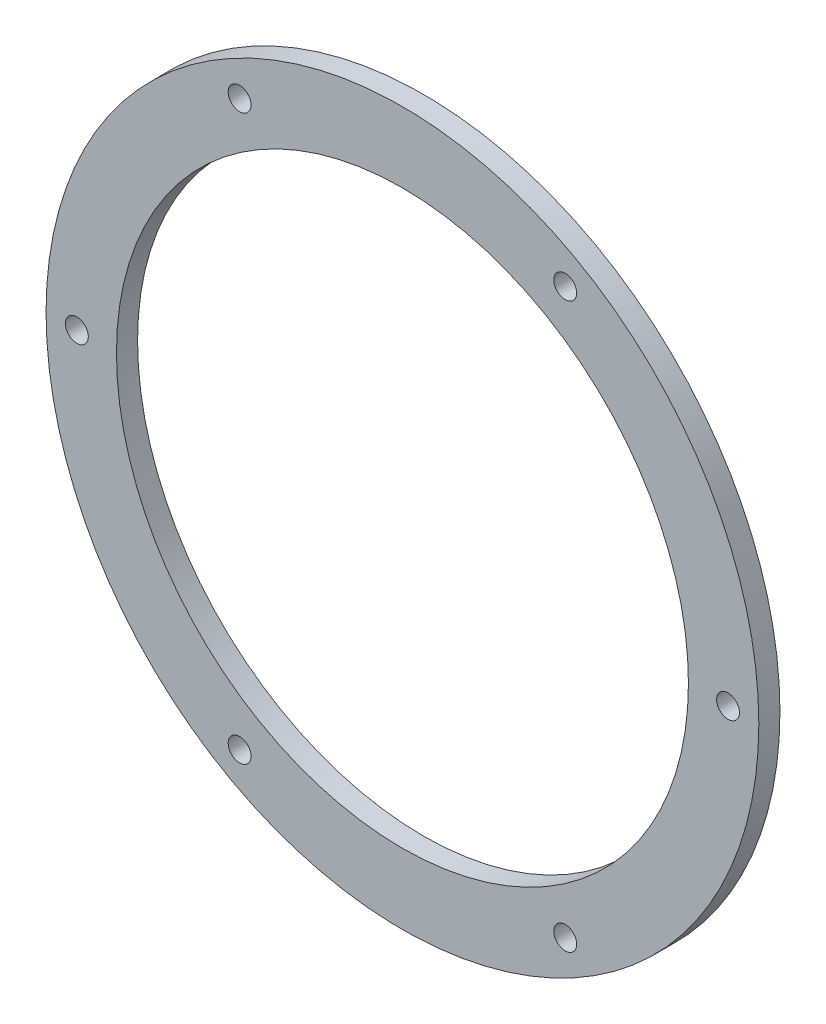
ISO-10303-21;
HEADER;
FILE_DESCRIPTION(('STEP AP214'),'2;1');
FILE_NAME('part.step','',(''),(''),'','','');
FILE_SCHEMA(('AUTOMOTIVE_DESIGN { 1 0 10303 214 1 1 1 1 }'));
ENDSEC;
DATA;
#1=APPLICATION_CONTEXT('core data for automotive mechanical design processes');
#2=APPLICATION_PROTOCOL_DEFINITION('international standard','automotive_design',2000,#1);
#3=PRODUCT_CONTEXT('',#1,'mechanical');
#4=PRODUCT('Part','Part','',(#3));
#5=PRODUCT_RELATED_PRODUCT_CATEGORY('part','',(#4));
#6=PRODUCT_DEFINITION_FORMATION('','',#4);
#7=PRODUCT_DEFINITION_CONTEXT('part definition',#1,'design');
#8=PRODUCT_DEFINITION('design','',#6,#7);
#9=PRODUCT_DEFINITION_SHAPE('','',#8);
#10=(LENGTH_UNIT() NAMED_UNIT(*) SI_UNIT(.MILLI.,.METRE.));
#11=(NAMED_UNIT(*) PLANE_ANGLE_UNIT() SI_UNIT($,.RADIAN.));
#12=(NAMED_UNIT(*) SI_UNIT($,.STERADIAN.) SOLID_ANGLE_UNIT());
#13=UNCERTAINTY_MEASURE_WITH_UNIT(LENGTH_MEASURE(1.E-05),#10,'distance_accuracy_value','');
#14=(GEOMETRIC_REPRESENTATION_CONTEXT(3) GLOBAL_UNCERTAINTY_ASSIGNED_CONTEXT((#13)) GLOBAL_UNIT_ASSIGNED_CONTEXT((#10,
#11,#12)) REPRESENTATION_CONTEXT('',''));
#15=CARTESIAN_POINT('',(0.,0.,0.));
#16=DIRECTION('',(0.,0.,1.));
#17=DIRECTION('',(1.,0.,0.));
#18=AXIS2_PLACEMENT_3D('',#15,#16,#17);
#19=CARTESIAN_POINT('',(0.,0.,12.));
#20=DIRECTION('',(0.,0.,1.));
#21=DIRECTION('',(1.,0.,0.));
#22=AXIS2_PLACEMENT_3D('',#19,#20,#21);
#23=PLANE('',#22);
#24=CARTESIAN_POINT('',(92.5000000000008,160.214699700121,12.));
#25=DIRECTION('',(0.,0.,-1.));
#26=DIRECTION('',(0.500000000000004,0.866025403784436,0.));
#27=AXIS2_PLACEMENT_3D('',#24,#25,#26);
#28=CIRCLE('',#27,6.50000000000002);
#29=CARTESIAN_POINT('',(95.7500000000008,165.84386482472,12.));
#30=VERTEX_POINT('',#29);
#31=EDGE_CURVE('E58',#30,#30,#28,.T.);
#32=ORIENTED_EDGE('',*,*,#31,.T.);
#33=EDGE_LOOP('',(#32));
#34=FACE_BOUND('',#33,.T.);
#35=CARTESIAN_POINT('',(185.,0.,12.));
#36=DIRECTION('',(0.,0.,-1.));
#37=DIRECTION('',(1.,0.,0.));
#38=AXIS2_PLACEMENT_3D('',#35,#36,#37);
#39=CIRCLE('',#38,6.50000000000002);
#40=CARTESIAN_POINT('',(191.5,0.,12.));
#41=VERTEX_POINT('',#40);
#42=EDGE_CURVE('E76',#41,#41,#39,.T.);
#43=ORIENTED_EDGE('',*,*,#42,.T.);
#44=EDGE_LOOP('',(#43));
#45=FACE_BOUND('',#44,.T.);
#46=CARTESIAN_POINT('',(92.4999999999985,-160.214699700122,12.));
#47=DIRECTION('',(0.,0.,-1.));
#48=DIRECTION('',(0.499999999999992,-0.866025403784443,0.));
#49=AXIS2_PLACEMENT_3D('',#46,#47,#48);
#50=CIRCLE('',#49,6.50000000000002);
#51=CARTESIAN_POINT('',(95.7499999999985,-165.843864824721,12.));
#52=VERTEX_POINT('',#51);
#53=EDGE_CURVE('E70',#52,#52,#50,.T.);
#54=ORIENTED_EDGE('',*,*,#53,.T.);
#55=EDGE_LOOP('',(#54));
#56=FACE_BOUND('',#55,.T.);
#57=CARTESIAN_POINT('',(-92.5000000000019,-160.21469970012,12.));
#58=DIRECTION('',(0.,0.,-1.));
#59=DIRECTION('',(-0.50000000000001,-0.866025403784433,0.));
#60=AXIS2_PLACEMENT_3D('',#57,#58,#59);
#61=CIRCLE('',#60,6.50000000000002);
#62=CARTESIAN_POINT('',(-95.7500000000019,-165.843864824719,12.));
#63=VERTEX_POINT('',#62);
#64=EDGE_CURVE('E64',#63,#63,#61,.T.);
#65=ORIENTED_EDGE('',*,*,#64,.T.);
#66=EDGE_LOOP('',(#65));
#67=FACE_BOUND('',#66,.T.);
#68=CARTESIAN_POINT('',(-92.4999999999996,160.214699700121,12.));
#69=DIRECTION('',(0.,0.,-1.));
#70=DIRECTION('',(-0.499999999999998,0.86602540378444,0.));
#71=AXIS2_PLACEMENT_3D('',#68,#69,#70);
#72=CIRCLE('',#71,6.50000000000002);
#73=CARTESIAN_POINT('',(-95.7499999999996,165.84386482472,12.));
#74=VERTEX_POINT('',#73);
#75=EDGE_CURVE('E52',#74,#74,#72,.T.);
#76=ORIENTED_EDGE('',*,*,#75,.T.);
#77=EDGE_LOOP('',(#76));
#78=FACE_BOUND('',#77,.T.);
#79=CARTESIAN_POINT('',(-185.,0.,12.));
#80=DIRECTION('',(0.,0.,-1.));
#81=DIRECTION('',(-1.,0.,0.));
#82=AXIS2_PLACEMENT_3D('',#79,#80,#81);
#83=CIRCLE('',#82,6.50000000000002);
#84=CARTESIAN_POINT('',(-191.5,0.,12.));
#85=VERTEX_POINT('',#84);
#86=EDGE_CURVE('E46',#85,#85,#83,.T.);
#87=ORIENTED_EDGE('',*,*,#86,.T.);
#88=EDGE_LOOP('',(#87));
#89=FACE_BOUND('',#88,.T.);
#90=CARTESIAN_POINT('',(0.,0.,12.));
#91=DIRECTION('',(0.,0.,1.));
#92=DIRECTION('',(1.,0.,0.));
#93=AXIS2_PLACEMENT_3D('',#90,#91,#92);
#94=CIRCLE('',#93,202.5);
#95=CARTESIAN_POINT('',(202.5,0.,12.));
#96=VERTEX_POINT('',#95);
#97=EDGE_CURVE('E10',#96,#96,#94,.T.);
#98=ORIENTED_EDGE('',*,*,#97,.T.);
#99=EDGE_LOOP('',(#98));
#100=FACE_BOUND('',#99,.T.);
#101=CARTESIAN_POINT('',(0.,0.,12.));
#102=DIRECTION('',(0.,0.,1.));
#103=DIRECTION('',(1.,0.,0.));
#104=AXIS2_PLACEMENT_3D('',#101,#102,#103);
#105=CIRCLE('',#104,162.5);
#106=CARTESIAN_POINT('',(162.5,0.,12.));
#107=VERTEX_POINT('',#106);
#108=EDGE_CURVE('E41',#107,#107,#105,.T.);
#109=ORIENTED_EDGE('',*,*,#108,.F.);
#110=EDGE_LOOP('',(#109));
#111=FACE_BOUND('',#110,.T.);
#112=ADVANCED_FACE('F30',(#34,#45,#56,#67,#78,#89,#100,#111),#23,.T.);
#113=CARTESIAN_POINT('',(0.,0.,0.));
#114=DIRECTION('',(0.,0.,1.));
#115=DIRECTION('',(1.,0.,0.));
#116=AXIS2_PLACEMENT_3D('',#113,#114,#115);
#117=PLANE('',#116);
#118=CARTESIAN_POINT('',(92.5000000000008,160.214699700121,0.));
#119=DIRECTION('',(0.,0.,-1.));
#120=DIRECTION('',(0.500000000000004,0.866025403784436,0.));
#121=AXIS2_PLACEMENT_3D('',#118,#119,#120);
#122=CIRCLE('',#121,6.50000000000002);
#123=CARTESIAN_POINT('',(95.7500000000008,165.84386482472,0.));
#124=VERTEX_POINT('',#123);
#125=EDGE_CURVE('E79',#124,#124,#122,.T.);
#126=ORIENTED_EDGE('',*,*,#125,.F.);
#127=EDGE_LOOP('',(#126));
#128=FACE_BOUND('',#127,.T.);
#129=CARTESIAN_POINT('',(185.,0.,0.));
#130=DIRECTION('',(0.,0.,-1.));
#131=DIRECTION('',(1.,0.,0.));
#132=AXIS2_PLACEMENT_3D('',#129,#130,#131);
#133=CIRCLE('',#132,6.50000000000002);
#134=CARTESIAN_POINT('',(191.5,0.,0.));
#135=VERTEX_POINT('',#134);
#136=EDGE_CURVE('E73',#135,#135,#133,.T.);
#137=ORIENTED_EDGE('',*,*,#136,.F.);
#138=EDGE_LOOP('',(#137));
#139=FACE_BOUND('',#138,.T.);
#140=CARTESIAN_POINT('',(92.4999999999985,-160.214699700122,0.));
#141=DIRECTION('',(0.,0.,-1.));
#142=DIRECTION('',(0.499999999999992,-0.866025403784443,0.));
#143=AXIS2_PLACEMENT_3D('',#140,#141,#142);
#144=CIRCLE('',#143,6.50000000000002);
#145=CARTESIAN_POINT('',(95.7499999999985,-165.843864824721,0.));
#146=VERTEX_POINT('',#145);
#147=EDGE_CURVE('E67',#146,#146,#144,.T.);
#148=ORIENTED_EDGE('',*,*,#147,.F.);
#149=EDGE_LOOP('',(#148));
#150=FACE_BOUND('',#149,.T.);
#151=CARTESIAN_POINT('',(-92.5000000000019,-160.21469970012,0.));
#152=DIRECTION('',(0.,0.,-1.));
#153=DIRECTION('',(-0.50000000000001,-0.866025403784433,0.));
#154=AXIS2_PLACEMENT_3D('',#151,#152,#153);
#155=CIRCLE('',#154,6.50000000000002);
#156=CARTESIAN_POINT('',(-95.7500000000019,-165.843864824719,0.));
#157=VERTEX_POINT('',#156);
#158=EDGE_CURVE('E61',#157,#157,#155,.T.);
#159=ORIENTED_EDGE('',*,*,#158,.F.);
#160=EDGE_LOOP('',(#159));
#161=FACE_BOUND('',#160,.T.);
#162=CARTESIAN_POINT('',(-92.4999999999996,160.214699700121,0.));
#163=DIRECTION('',(0.,0.,-1.));
#164=DIRECTION('',(-0.499999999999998,0.86602540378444,0.));
#165=AXIS2_PLACEMENT_3D('',#162,#163,#164);
#166=CIRCLE('',#165,6.50000000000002);
#167=CARTESIAN_POINT('',(-95.7499999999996,165.84386482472,0.));
#168=VERTEX_POINT('',#167);
#169=EDGE_CURVE('E55',#168,#168,#166,.T.);
#170=ORIENTED_EDGE('',*,*,#169,.F.);
#171=EDGE_LOOP('',(#170));
#172=FACE_BOUND('',#171,.T.);
#173=CARTESIAN_POINT('',(-185.,0.,0.));
#174=DIRECTION('',(0.,0.,-1.));
#175=DIRECTION('',(-1.,0.,0.));
#176=AXIS2_PLACEMENT_3D('',#173,#174,#175);
#177=CIRCLE('',#176,6.50000000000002);
#178=CARTESIAN_POINT('',(-191.5,0.,0.));
#179=VERTEX_POINT('',#178);
#180=EDGE_CURVE('E49',#179,#179,#177,.T.);
#181=ORIENTED_EDGE('',*,*,#180,.F.);
#182=EDGE_LOOP('',(#181));
#183=FACE_BOUND('',#182,.T.);
#184=CARTESIAN_POINT('',(0.,0.,0.));
#185=DIRECTION('',(0.,0.,1.));
#186=DIRECTION('',(1.,0.,0.));
#187=AXIS2_PLACEMENT_3D('',#184,#185,#186);
#188=CIRCLE('',#187,202.5);
#189=CARTESIAN_POINT('',(202.5,0.,0.));
#190=VERTEX_POINT('',#189);
#191=EDGE_CURVE('E34',#190,#190,#188,.T.);
#192=ORIENTED_EDGE('',*,*,#191,.F.);
#193=EDGE_LOOP('',(#192));
#194=FACE_BOUND('',#193,.T.);
#195=CARTESIAN_POINT('',(0.,0.,0.));
#196=DIRECTION('',(0.,0.,1.));
#197=DIRECTION('',(1.,0.,0.));
#198=AXIS2_PLACEMENT_3D('',#195,#196,#197);
#199=CIRCLE('',#198,162.5);
#200=CARTESIAN_POINT('',(162.5,0.,0.));
#201=VERTEX_POINT('',#200);
#202=EDGE_CURVE('E43',#201,#201,#199,.T.);
#203=ORIENTED_EDGE('',*,*,#202,.T.);
#204=EDGE_LOOP('',(#203));
#205=FACE_BOUND('',#204,.T.);
#206=ADVANCED_FACE('F94',(#128,#139,#150,#161,#172,#183,#194,#205),#117,.F.);
#207=CARTESIAN_POINT('',(0.,0.,12.));
#208=DIRECTION('',(0.,0.,-1.));
#209=DIRECTION('',(-1.,0.,0.));
#210=AXIS2_PLACEMENT_3D('',#207,#208,#209);
#211=CYLINDRICAL_SURFACE('',#210,202.5);
#212=ORIENTED_EDGE('',*,*,#97,.F.);
#213=EDGE_LOOP('',(#212));
#214=FACE_BOUND('',#213,.T.);
#215=ORIENTED_EDGE('',*,*,#191,.T.);
#216=EDGE_LOOP('',(#215));
#217=FACE_BOUND('',#216,.T.);
#218=ADVANCED_FACE('F32',(#214,#217),#211,.T.);
#219=CARTESIAN_POINT('',(0.,0.,12.));
#220=DIRECTION('',(0.,0.,-1.));
#221=DIRECTION('',(-1.,0.,0.));
#222=AXIS2_PLACEMENT_3D('',#219,#220,#221);
#223=CYLINDRICAL_SURFACE('',#222,162.5);
#224=ORIENTED_EDGE('',*,*,#108,.T.);
#225=EDGE_LOOP('',(#224));
#226=FACE_BOUND('',#225,.T.);
#227=ORIENTED_EDGE('',*,*,#202,.F.);
#228=EDGE_LOOP('',(#227));
#229=FACE_BOUND('',#228,.T.);
#230=ADVANCED_FACE('F111',(#226,#229),#223,.F.);
#231=CARTESIAN_POINT('',(-185.,0.,12.));
#232=DIRECTION('',(0.,0.,-1.));
#233=DIRECTION('',(-1.,0.,0.));
#234=AXIS2_PLACEMENT_3D('',#231,#232,#233);
#235=CYLINDRICAL_SURFACE('',#234,6.50000000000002);
#236=ORIENTED_EDGE('',*,*,#86,.F.);
#237=EDGE_LOOP('',(#236));
#238=FACE_BOUND('',#237,.T.);
#239=ORIENTED_EDGE('',*,*,#180,.T.);
#240=EDGE_LOOP('',(#239));
#241=FACE_BOUND('',#240,.T.);
#242=ADVANCED_FACE('F113',(#238,#241),#235,.F.);
#243=CARTESIAN_POINT('',(-92.4999999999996,160.214699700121,12.));
#244=DIRECTION('',(0.,0.,-1.));
#245=DIRECTION('',(-1.,0.,0.));
#246=AXIS2_PLACEMENT_3D('',#243,#244,#245);
#247=CYLINDRICAL_SURFACE('',#246,6.50000000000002);
#248=ORIENTED_EDGE('',*,*,#75,.F.);
#249=EDGE_LOOP('',(#248));
#250=FACE_BOUND('',#249,.T.);
#251=ORIENTED_EDGE('',*,*,#169,.T.);
#252=EDGE_LOOP('',(#251));
#253=FACE_BOUND('',#252,.T.);
#254=ADVANCED_FACE('F120',(#250,#253),#247,.F.);
#255=CARTESIAN_POINT('',(-92.5000000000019,-160.21469970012,12.));
#256=DIRECTION('',(0.,0.,-1.));
#257=DIRECTION('',(-1.,0.,0.));
#258=AXIS2_PLACEMENT_3D('',#255,#256,#257);
#259=CYLINDRICAL_SURFACE('',#258,6.50000000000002);
#260=ORIENTED_EDGE('',*,*,#64,.F.);
#261=EDGE_LOOP('',(#260));
#262=FACE_BOUND('',#261,.T.);
#263=ORIENTED_EDGE('',*,*,#158,.T.);
#264=EDGE_LOOP('',(#263));
#265=FACE_BOUND('',#264,.T.);
#266=ADVANCED_FACE('F155',(#262,#265),#259,.F.);
#267=CARTESIAN_POINT('',(92.4999999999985,-160.214699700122,12.));
#268=DIRECTION('',(0.,0.,-1.));
#269=DIRECTION('',(-1.,0.,0.));
#270=AXIS2_PLACEMENT_3D('',#267,#268,#269);
#271=CYLINDRICAL_SURFACE('',#270,6.50000000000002);
#272=ORIENTED_EDGE('',*,*,#53,.F.);
#273=EDGE_LOOP('',(#272));
#274=FACE_BOUND('',#273,.T.);
#275=ORIENTED_EDGE('',*,*,#147,.T.);
#276=EDGE_LOOP('',(#275));
#277=FACE_BOUND('',#276,.T.);
#278=ADVANCED_FACE('F162',(#274,#277),#271,.F.);
#279=CARTESIAN_POINT('',(185.,0.,12.));
#280=DIRECTION('',(0.,0.,-1.));
#281=DIRECTION('',(-1.,0.,0.));
#282=AXIS2_PLACEMENT_3D('',#279,#280,#281);
#283=CYLINDRICAL_SURFACE('',#282,6.50000000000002);
#284=ORIENTED_EDGE('',*,*,#42,.F.);
#285=EDGE_LOOP('',(#284));
#286=FACE_BOUND('',#285,.T.);
#287=ORIENTED_EDGE('',*,*,#136,.T.);
#288=EDGE_LOOP('',(#287));
#289=FACE_BOUND('',#288,.T.);
#290=ADVANCED_FACE('F90',(#286,#289),#283,.F.);
#291=CARTESIAN_POINT('',(92.5000000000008,160.214699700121,12.));
#292=DIRECTION('',(0.,0.,-1.));
#293=DIRECTION('',(-1.,0.,0.));
#294=AXIS2_PLACEMENT_3D('',#291,#292,#293);
#295=CYLINDRICAL_SURFACE('',#294,6.50000000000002);
#296=ORIENTED_EDGE('',*,*,#31,.F.);
#297=EDGE_LOOP('',(#296));
#298=FACE_BOUND('',#297,.T.);
#299=ORIENTED_EDGE('',*,*,#125,.T.);
#300=EDGE_LOOP('',(#299));
#301=FACE_BOUND('',#300,.T.);
#302=ADVANCED_FACE('F87',(#298,#301),#295,.F.);
#303=CLOSED_SHELL('',(#112,#206,#218,#230,#242,#254,#266,#278,#290,#302));
#304=MANIFOLD_SOLID_BREP('B2',#303);
#305=ADVANCED_BREP_SHAPE_REPRESENTATION('',(#18,#304),#14);
#306=SHAPE_DEFINITION_REPRESENTATION(#9,#305);
ENDSEC;
END-ISO-10303-21;
